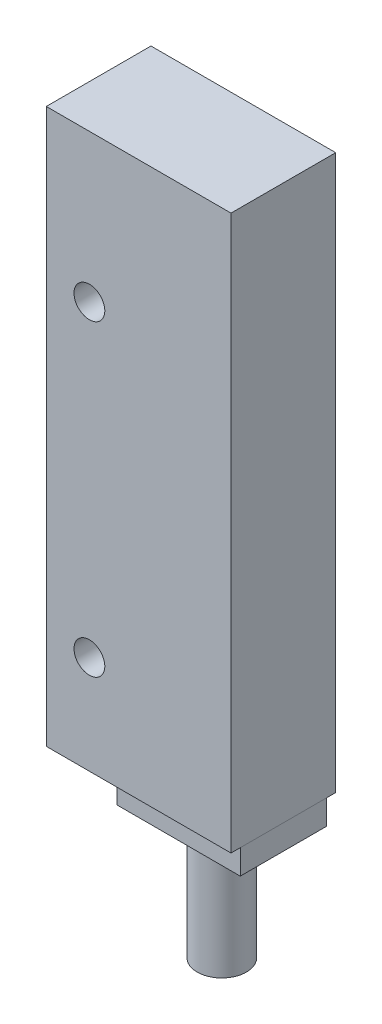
from build123d import *

# Parameters (mm, degrees)
ESQUISSE1_W      = 15
ESQUISSE1_H      = 45
ESQUISSE1_R      = 1.25
EXTRUSION1_DEPTH = 4.25
ESQUISSE2_W      = 10
ESQUISSE2_H      = 2
EXTRUSION2_DEPTH = 3.5
ESQUISSE3_R      = 2
EXTRUSION3_DEPTH = 10
ESQUISSE4_R      = 2.5
EXTRUSION4_DEPTH = 0.5


with BuildPart() as part:
    # Esquisse1 → Extrusion1 (new, symmetric)
    with BuildSketch(Plane.XY):
        with Locations((-7.5, 0)):
            Rectangle(ESQUISSE1_W, ESQUISSE1_H)
        with Locations((-11.5, 10.5)):
            Circle(ESQUISSE1_R, mode=Mode.SUBTRACT)
        with Locations((-11.5, -14.5)):
            Circle(ESQUISSE1_R, mode=Mode.SUBTRACT)
    extrude(amount=EXTRUSION1_DEPTH, both=True)

    # Esquisse4 → Extrusion4 (add)
    with BuildSketch(Plane.ZY.offset(15)):
        with Locations(Location((0, 17.5, 0), (0, 0, 180))):
            Circle(ESQUISSE4_R)
    extrude(amount=EXTRUSION4_DEPTH)


with BuildPart() as body_2:
    # Esquisse2 → Extrusion2 (new, symmetric)
    with BuildSketch(Plane.XY):
        with Locations((-5, -23.5)):
            Rectangle(ESQUISSE2_W, ESQUISSE2_H)
    extrude(amount=EXTRUSION2_DEPTH, both=True)

    # Esquisse3 → Extrusion3 (add)
    with BuildSketch(Plane.XZ.offset(24.5)):
        with Locations(Location((-5, 0, 0), (0, 0, 90))):
            Circle(ESQUISSE3_R)
    extrude(amount=EXTRUSION3_DEPTH)


solid = Compound([part.part, body_2.part])
